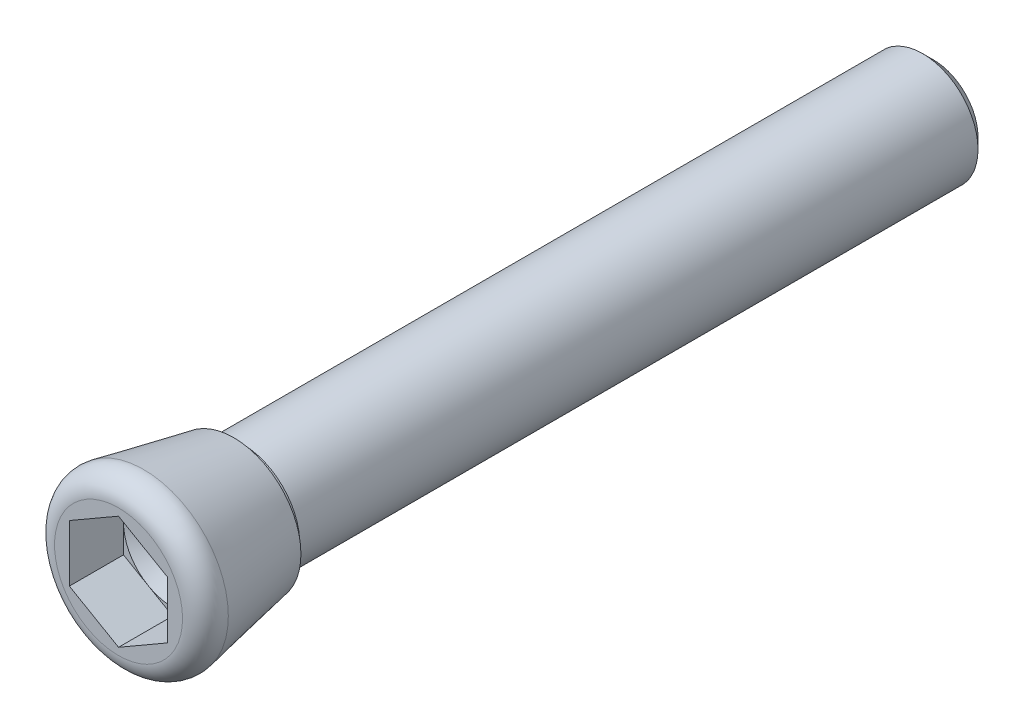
ISO-10303-21;
HEADER;
FILE_DESCRIPTION(('STEP AP214'),'2;1');
FILE_NAME('part.step','',(''),(''),'','','');
FILE_SCHEMA(('AUTOMOTIVE_DESIGN { 1 0 10303 214 1 1 1 1 }'));
ENDSEC;
DATA;
#1=APPLICATION_CONTEXT('core data for automotive mechanical design processes');
#2=APPLICATION_PROTOCOL_DEFINITION('international standard','automotive_design',2000,#1);
#3=PRODUCT_CONTEXT('',#1,'mechanical');
#4=PRODUCT('Part','Part','',(#3));
#5=PRODUCT_RELATED_PRODUCT_CATEGORY('part','',(#4));
#6=PRODUCT_DEFINITION_FORMATION('','',#4);
#7=PRODUCT_DEFINITION_CONTEXT('part definition',#1,'design');
#8=PRODUCT_DEFINITION('design','',#6,#7);
#9=PRODUCT_DEFINITION_SHAPE('','',#8);
#10=(LENGTH_UNIT() NAMED_UNIT(*) SI_UNIT(.MILLI.,.METRE.));
#11=(NAMED_UNIT(*) PLANE_ANGLE_UNIT() SI_UNIT($,.RADIAN.));
#12=(NAMED_UNIT(*) SI_UNIT($,.STERADIAN.) SOLID_ANGLE_UNIT());
#13=UNCERTAINTY_MEASURE_WITH_UNIT(LENGTH_MEASURE(1.E-05),#10,'distance_accuracy_value','');
#14=(GEOMETRIC_REPRESENTATION_CONTEXT(3) GLOBAL_UNCERTAINTY_ASSIGNED_CONTEXT((#13)) GLOBAL_UNIT_ASSIGNED_CONTEXT((#10,
#11,#12)) REPRESENTATION_CONTEXT('',''));
#15=CARTESIAN_POINT('',(0.,0.,0.));
#16=DIRECTION('',(0.,0.,1.));
#17=DIRECTION('',(1.,0.,0.));
#18=AXIS2_PLACEMENT_3D('',#15,#16,#17);
#19=CARTESIAN_POINT('',(0.,3.429,-4.1656));
#20=DIRECTION('',(0.,0.,-1.));
#21=DIRECTION('',(-1.,0.,0.));
#22=AXIS2_PLACEMENT_3D('',#19,#20,#21);
#23=PLANE('',#22);
#24=CARTESIAN_POINT('',(0.,0.,-4.1656));
#25=DIRECTION('',(0.,0.,-1.));
#26=DIRECTION('',(-1.,0.,0.));
#27=AXIS2_PLACEMENT_3D('',#24,#25,#26);
#28=CIRCLE('',#27,2.38759999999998);
#29=CARTESIAN_POINT('',(-2.38759999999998,0.,-4.1656));
#30=VERTEX_POINT('',#29);
#31=EDGE_CURVE('E9',#30,#30,#28,.F.);
#32=ORIENTED_EDGE('',*,*,#31,.T.);
#33=EDGE_LOOP('',(#32));
#34=FACE_BOUND('',#33,.T.);
#35=CARTESIAN_POINT('',(0.,0.,-4.1656));
#36=DIRECTION('',(0.,0.,-1.));
#37=DIRECTION('',(-1.,0.,0.));
#38=AXIS2_PLACEMENT_3D('',#35,#36,#37);
#39=CIRCLE('',#38,2.42878938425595);
#40=CARTESIAN_POINT('',(-2.42878938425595,0.,-4.1656));
#41=VERTEX_POINT('',#40);
#42=EDGE_CURVE('E114',#41,#41,#39,.T.);
#43=ORIENTED_EDGE('',*,*,#42,.T.);
#44=EDGE_LOOP('',(#43));
#45=FACE_BOUND('',#44,.T.);
#46=ADVANCED_FACE('F14',(#34,#45),#23,.T.);
#47=CARTESIAN_POINT('',(0.,0.,-4.4704));
#48=DIRECTION('',(0.,0.,-1.));
#49=DIRECTION('',(-1.,0.,0.));
#50=AXIS2_PLACEMENT_3D('',#47,#48,#49);
#51=TOROIDAL_SURFACE('',#50,2.38759999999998,0.3048);
#52=CARTESIAN_POINT('',(0.,0.,-4.4704));
#53=DIRECTION('',(0.,0.,-1.));
#54=DIRECTION('',(-1.,0.,0.));
#55=AXIS2_PLACEMENT_3D('',#52,#53,#54);
#56=CIRCLE('',#55,2.08279999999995);
#57=CARTESIAN_POINT('',(-2.08279999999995,0.,-4.4704));
#58=VERTEX_POINT('',#57);
#59=EDGE_CURVE('E209',#58,#58,#56,.F.);
#60=ORIENTED_EDGE('',*,*,#59,.T.);
#61=EDGE_LOOP('',(#60));
#62=FACE_BOUND('',#61,.T.);
#63=ORIENTED_EDGE('',*,*,#31,.F.);
#64=EDGE_LOOP('',(#63));
#65=FACE_BOUND('',#64,.T.);
#66=ADVANCED_FACE('F186',(#62,#65),#51,.F.);
#67=CARTESIAN_POINT('',(0.,0.,-0.907396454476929));
#68=DIRECTION('',(0.,0.,1.));
#69=DIRECTION('',(1.,0.,0.));
#70=AXIS2_PLACEMENT_3D('',#67,#68,#69);
#71=CONICAL_SURFACE('',#70,3.06211999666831,0.19198621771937);
#72=ORIENTED_EDGE('',*,*,#42,.F.);
#73=EDGE_LOOP('',(#72));
#74=FACE_BOUND('',#73,.T.);
#75=CARTESIAN_POINT('',(0.,0.,-0.907396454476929));
#76=DIRECTION('',(0.,0.,1.));
#77=DIRECTION('',(1.,0.,0.));
#78=AXIS2_PLACEMENT_3D('',#75,#76,#77);
#79=CIRCLE('',#78,3.06211999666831);
#80=CARTESIAN_POINT('',(3.06211999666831,0.,-0.907396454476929));
#81=VERTEX_POINT('',#80);
#82=EDGE_CURVE('E117',#81,#81,#79,.T.);
#83=ORIENTED_EDGE('',*,*,#82,.F.);
#84=EDGE_LOOP('',(#83));
#85=FACE_BOUND('',#84,.T.);
#86=ADVANCED_FACE('F192',(#74,#85),#71,.T.);
#87=CARTESIAN_POINT('',(0.,0.,-0.762));
#88=DIRECTION('',(0.,0.,1.));
#89=DIRECTION('',(1.,0.,0.));
#90=AXIS2_PLACEMENT_3D('',#87,#88,#89);
#91=TOROIDAL_SURFACE('',#90,2.31412008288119,0.762);
#92=ORIENTED_EDGE('',*,*,#82,.T.);
#93=EDGE_LOOP('',(#92));
#94=FACE_BOUND('',#93,.T.);
#95=CARTESIAN_POINT('',(0.,0.,0.));
#96=DIRECTION('',(0.,0.,1.));
#97=DIRECTION('',(1.,0.,0.));
#98=AXIS2_PLACEMENT_3D('',#95,#96,#97);
#99=CIRCLE('',#98,2.31412008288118);
#100=CARTESIAN_POINT('',(2.31412008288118,0.,0.));
#101=VERTEX_POINT('',#100);
#102=EDGE_CURVE('E205',#101,#101,#99,.T.);
#103=ORIENTED_EDGE('',*,*,#102,.F.);
#104=EDGE_LOOP('',(#103));
#105=FACE_BOUND('',#104,.T.);
#106=ADVANCED_FACE('F200',(#94,#105),#91,.T.);
#107=CARTESIAN_POINT('',(0.,0.,-1.9558));
#108=DIRECTION('',(0.,0.,1.));
#109=DIRECTION('',(1.,0.,0.));
#110=AXIS2_PLACEMENT_3D('',#107,#108,#109);
#111=CONICAL_SURFACE('',#110,1.778,1.04719755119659);
#112=CARTESIAN_POINT('',(0.,0.,-2.98232877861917));
#113=VERTEX_POINT('',#112);
#114=VERTEX_LOOP('',#113);
#115=FACE_BOUND('',#114,.T.);
#116=CARTESIAN_POINT('',(0.,0.,-1.9558));
#117=DIRECTION('',(0.,0.,1.));
#118=DIRECTION('',(1.,0.,0.));
#119=AXIS2_PLACEMENT_3D('',#116,#117,#118);
#120=CIRCLE('',#119,1.778);
#121=CARTESIAN_POINT('',(1.778,0.,-1.9558));
#122=VERTEX_POINT('',#121);
#123=CARTESIAN_POINT('',(0.889,1.53979316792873,-1.9558));
#124=VERTEX_POINT('',#123);
#125=EDGE_CURVE('E160',#122,#124,#120,.T.);
#126=ORIENTED_EDGE('',*,*,#125,.T.);
#127=CARTESIAN_POINT('',(-0.889,1.53979316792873,-1.9558));
#128=VERTEX_POINT('',#127);
#129=EDGE_CURVE('E163',#124,#128,#120,.T.);
#130=ORIENTED_EDGE('',*,*,#129,.T.);
#131=CARTESIAN_POINT('',(-1.778,0.,-1.9558));
#132=VERTEX_POINT('',#131);
#133=EDGE_CURVE('E290',#128,#132,#120,.T.);
#134=ORIENTED_EDGE('',*,*,#133,.T.);
#135=CARTESIAN_POINT('',(-0.889,-1.53979316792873,-1.9558));
#136=VERTEX_POINT('',#135);
#137=EDGE_CURVE('E286',#132,#136,#120,.T.);
#138=ORIENTED_EDGE('',*,*,#137,.T.);
#139=CARTESIAN_POINT('',(0.889,-1.53979316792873,-1.9558));
#140=VERTEX_POINT('',#139);
#141=EDGE_CURVE('E284',#136,#140,#120,.T.);
#142=ORIENTED_EDGE('',*,*,#141,.T.);
#143=EDGE_CURVE('E108',#140,#122,#120,.T.);
#144=ORIENTED_EDGE('',*,*,#143,.T.);
#145=EDGE_LOOP('',(#126,#130,#134,#138,#142,#144));
#146=FACE_BOUND('',#145,.T.);
#147=ADVANCED_FACE('F237',(#115,#146),#111,.F.);
#148=CARTESIAN_POINT('',(0.,2.05305755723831,-1.9558));
#149=DIRECTION('',(0.,0.,-1.));
#150=DIRECTION('',(-1.,0.,0.));
#151=AXIS2_PLACEMENT_3D('',#148,#149,#150);
#152=PLANE('',#151);
#153=DIRECTION('',(-0.866025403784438,-0.5,0.));
#154=VECTOR('',#153,1.);
#155=CARTESIAN_POINT('',(0.,2.05305755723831,-1.9558));
#156=LINE('',#155,#154);
#157=CARTESIAN_POINT('',(-1.778,1.02652877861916,-1.9558));
#158=VERTEX_POINT('',#157);
#159=EDGE_CURVE('E144',#128,#158,#156,.T.);
#160=ORIENTED_EDGE('',*,*,#159,.T.);
#161=DIRECTION('',(0.,-1.,0.));
#162=VECTOR('',#161,1.);
#163=CARTESIAN_POINT('',(-1.778,1.02652877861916,-1.9558));
#164=LINE('',#163,#162);
#165=EDGE_CURVE('E31',#158,#132,#164,.T.);
#166=ORIENTED_EDGE('',*,*,#165,.T.);
#167=ORIENTED_EDGE('',*,*,#133,.F.);
#168=EDGE_LOOP('',(#160,#166,#167));
#169=FACE_BOUND('',#168,.T.);
#170=ADVANCED_FACE('F243',(#169),#152,.F.);
#171=CARTESIAN_POINT('',(-1.778,-1.02652877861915,-1.9558));
#172=VERTEX_POINT('',#171);
#173=EDGE_CURVE('E142',#132,#172,#164,.T.);
#174=ORIENTED_EDGE('',*,*,#173,.T.);
#175=DIRECTION('',(-0.866025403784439,0.5,0.));
#176=VECTOR('',#175,1.);
#177=CARTESIAN_POINT('',(0.,-2.05305755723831,-1.9558));
#178=LINE('',#177,#176);
#179=EDGE_CURVE('E138',#136,#172,#178,.T.);
#180=ORIENTED_EDGE('',*,*,#179,.F.);
#181=ORIENTED_EDGE('',*,*,#137,.F.);
#182=EDGE_LOOP('',(#174,#180,#181));
#183=FACE_BOUND('',#182,.T.);
#184=ADVANCED_FACE('F239',(#183),#152,.F.);
#185=CARTESIAN_POINT('',(0.,-2.05305755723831,-1.9558));
#186=VERTEX_POINT('',#185);
#187=EDGE_CURVE('E139',#186,#136,#178,.T.);
#188=ORIENTED_EDGE('',*,*,#187,.F.);
#189=DIRECTION('',(-0.866025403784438,-0.5,0.));
#190=VECTOR('',#189,1.);
#191=CARTESIAN_POINT('',(1.778,-1.02652877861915,-1.9558));
#192=LINE('',#191,#190);
#193=EDGE_CURVE('E134',#140,#186,#192,.T.);
#194=ORIENTED_EDGE('',*,*,#193,.F.);
#195=ORIENTED_EDGE('',*,*,#141,.F.);
#196=EDGE_LOOP('',(#188,#194,#195));
#197=FACE_BOUND('',#196,.T.);
#198=ADVANCED_FACE('F242',(#197),#152,.F.);
#199=CARTESIAN_POINT('',(1.778,-1.02652877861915,-1.9558));
#200=VERTEX_POINT('',#199);
#201=EDGE_CURVE('E135',#200,#140,#192,.T.);
#202=ORIENTED_EDGE('',*,*,#201,.F.);
#203=DIRECTION('',(0.,1.,0.));
#204=VECTOR('',#203,1.);
#205=CARTESIAN_POINT('',(1.778,-1.02652877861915,-1.9558));
#206=LINE('',#205,#204);
#207=EDGE_CURVE('E131',#200,#122,#206,.T.);
#208=ORIENTED_EDGE('',*,*,#207,.T.);
#209=ORIENTED_EDGE('',*,*,#143,.F.);
#210=EDGE_LOOP('',(#202,#208,#209));
#211=FACE_BOUND('',#210,.T.);
#212=ADVANCED_FACE('F280',(#211),#152,.F.);
#213=CARTESIAN_POINT('',(1.778,1.02652877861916,-1.9558));
#214=VERTEX_POINT('',#213);
#215=EDGE_CURVE('E130',#122,#214,#206,.T.);
#216=ORIENTED_EDGE('',*,*,#215,.T.);
#217=DIRECTION('',(0.866025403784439,-0.5,0.));
#218=VECTOR('',#217,1.);
#219=CARTESIAN_POINT('',(0.,2.05305755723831,-1.9558));
#220=LINE('',#219,#218);
#221=EDGE_CURVE('E107',#124,#214,#220,.T.);
#222=ORIENTED_EDGE('',*,*,#221,.F.);
#223=ORIENTED_EDGE('',*,*,#125,.F.);
#224=EDGE_LOOP('',(#216,#222,#223));
#225=FACE_BOUND('',#224,.T.);
#226=ADVANCED_FACE('F277',(#225),#152,.F.);
#227=CARTESIAN_POINT('',(0.,2.05305755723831,-1.9558));
#228=VERTEX_POINT('',#227);
#229=EDGE_CURVE('E128',#228,#124,#220,.T.);
#230=ORIENTED_EDGE('',*,*,#229,.F.);
#231=EDGE_CURVE('E145',#228,#128,#156,.T.);
#232=ORIENTED_EDGE('',*,*,#231,.T.);
#233=ORIENTED_EDGE('',*,*,#129,.F.);
#234=EDGE_LOOP('',(#230,#232,#233));
#235=FACE_BOUND('',#234,.T.);
#236=ADVANCED_FACE('F249',(#235),#152,.F.);
#237=CARTESIAN_POINT('',(0.,2.05305755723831,-1.9558));
#238=DIRECTION('',(-0.5,0.866025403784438,0.));
#239=DIRECTION('',(0.866025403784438,0.5,0.));
#240=AXIS2_PLACEMENT_3D('',#237,#238,#239);
#241=PLANE('',#240);
#242=DIRECTION('',(-0.866025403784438,-0.5,0.));
#243=VECTOR('',#242,1.);
#244=CARTESIAN_POINT('',(0.,2.05305755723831,0.));
#245=LINE('',#244,#243);
#246=CARTESIAN_POINT('',(0.,2.05305755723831,0.));
#247=VERTEX_POINT('',#246);
#248=CARTESIAN_POINT('',(-1.778,1.02652877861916,0.));
#249=VERTEX_POINT('',#248);
#250=EDGE_CURVE('E113',#247,#249,#245,.T.);
#251=ORIENTED_EDGE('',*,*,#250,.T.);
#252=DIRECTION('',(0.,0.,1.));
#253=VECTOR('',#252,1.);
#254=CARTESIAN_POINT('',(-1.778,1.02652877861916,-1.9558));
#255=LINE('',#254,#253);
#256=EDGE_CURVE('E150',#158,#249,#255,.T.);
#257=ORIENTED_EDGE('',*,*,#256,.F.);
#258=ORIENTED_EDGE('',*,*,#159,.F.);
#259=ORIENTED_EDGE('',*,*,#231,.F.);
#260=DIRECTION('',(0.,0.,1.));
#261=VECTOR('',#260,1.);
#262=CARTESIAN_POINT('',(0.,2.05305755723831,-1.9558));
#263=LINE('',#262,#261);
#264=EDGE_CURVE('E148',#228,#247,#263,.T.);
#265=ORIENTED_EDGE('',*,*,#264,.T.);
#266=EDGE_LOOP('',(#251,#257,#258,#259,#265));
#267=FACE_BOUND('',#266,.T.);
#268=ADVANCED_FACE('F245',(#267),#241,.F.);
#269=CARTESIAN_POINT('',(-1.778,1.02652877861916,-1.9558));
#270=DIRECTION('',(-1.,0.,0.));
#271=DIRECTION('',(0.,1.,0.));
#272=AXIS2_PLACEMENT_3D('',#269,#270,#271);
#273=PLANE('',#272);
#274=DIRECTION('',(0.,-1.,0.));
#275=VECTOR('',#274,1.);
#276=CARTESIAN_POINT('',(-1.778,1.02652877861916,0.));
#277=LINE('',#276,#275);
#278=CARTESIAN_POINT('',(-1.778,-1.02652877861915,0.));
#279=VERTEX_POINT('',#278);
#280=EDGE_CURVE('E125',#249,#279,#277,.T.);
#281=ORIENTED_EDGE('',*,*,#280,.T.);
#282=DIRECTION('',(0.,0.,1.));
#283=VECTOR('',#282,1.);
#284=CARTESIAN_POINT('',(-1.778,-1.02652877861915,-1.9558));
#285=LINE('',#284,#283);
#286=EDGE_CURVE('E153',#172,#279,#285,.T.);
#287=ORIENTED_EDGE('',*,*,#286,.F.);
#288=ORIENTED_EDGE('',*,*,#173,.F.);
#289=ORIENTED_EDGE('',*,*,#165,.F.);
#290=ORIENTED_EDGE('',*,*,#256,.T.);
#291=EDGE_LOOP('',(#281,#287,#288,#289,#290));
#292=FACE_BOUND('',#291,.T.);
#293=ADVANCED_FACE('F248',(#292),#273,.F.);
#294=CARTESIAN_POINT('',(0.,-2.05305755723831,-1.9558));
#295=DIRECTION('',(0.5,0.866025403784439,0.));
#296=DIRECTION('',(0.866025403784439,-0.5,0.));
#297=AXIS2_PLACEMENT_3D('',#294,#295,#296);
#298=PLANE('',#297);
#299=DIRECTION('',(-0.866025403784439,0.5,0.));
#300=VECTOR('',#299,1.);
#301=CARTESIAN_POINT('',(0.,-2.05305755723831,0.));
#302=LINE('',#301,#300);
#303=CARTESIAN_POINT('',(0.,-2.05305755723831,0.));
#304=VERTEX_POINT('',#303);
#305=EDGE_CURVE('E122',#304,#279,#302,.T.);
#306=ORIENTED_EDGE('',*,*,#305,.F.);
#307=DIRECTION('',(0.,0.,1.));
#308=VECTOR('',#307,1.);
#309=CARTESIAN_POINT('',(0.,-2.05305755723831,-1.9558));
#310=LINE('',#309,#308);
#311=EDGE_CURVE('E156',#186,#304,#310,.T.);
#312=ORIENTED_EDGE('',*,*,#311,.F.);
#313=ORIENTED_EDGE('',*,*,#187,.T.);
#314=ORIENTED_EDGE('',*,*,#179,.T.);
#315=ORIENTED_EDGE('',*,*,#286,.T.);
#316=EDGE_LOOP('',(#306,#312,#313,#314,#315));
#317=FACE_BOUND('',#316,.T.);
#318=ADVANCED_FACE('F253',(#317),#298,.T.);
#319=CARTESIAN_POINT('',(1.778,-1.02652877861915,-1.9558));
#320=DIRECTION('',(-0.5,0.866025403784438,0.));
#321=DIRECTION('',(0.866025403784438,0.5,0.));
#322=AXIS2_PLACEMENT_3D('',#319,#320,#321);
#323=PLANE('',#322);
#324=DIRECTION('',(-0.866025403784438,-0.5,0.));
#325=VECTOR('',#324,1.);
#326=CARTESIAN_POINT('',(1.778,-1.02652877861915,0.));
#327=LINE('',#326,#325);
#328=CARTESIAN_POINT('',(1.778,-1.02652877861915,0.));
#329=VERTEX_POINT('',#328);
#330=EDGE_CURVE('E98',#329,#304,#327,.T.);
#331=ORIENTED_EDGE('',*,*,#330,.F.);
#332=DIRECTION('',(0.,0.,1.));
#333=VECTOR('',#332,1.);
#334=CARTESIAN_POINT('',(1.778,-1.02652877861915,-1.9558));
#335=LINE('',#334,#333);
#336=EDGE_CURVE('E94',#200,#329,#335,.T.);
#337=ORIENTED_EDGE('',*,*,#336,.F.);
#338=ORIENTED_EDGE('',*,*,#201,.T.);
#339=ORIENTED_EDGE('',*,*,#193,.T.);
#340=ORIENTED_EDGE('',*,*,#311,.T.);
#341=EDGE_LOOP('',(#331,#337,#338,#339,#340));
#342=FACE_BOUND('',#341,.T.);
#343=ADVANCED_FACE('F257',(#342),#323,.T.);
#344=CARTESIAN_POINT('',(1.778,-1.02652877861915,-1.9558));
#345=DIRECTION('',(1.,0.,0.));
#346=DIRECTION('',(0.,-1.,0.));
#347=AXIS2_PLACEMENT_3D('',#344,#345,#346);
#348=PLANE('',#347);
#349=DIRECTION('',(0.,1.,0.));
#350=VECTOR('',#349,1.);
#351=CARTESIAN_POINT('',(1.778,-1.02652877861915,0.));
#352=LINE('',#351,#350);
#353=CARTESIAN_POINT('',(1.778,1.02652877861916,0.));
#354=VERTEX_POINT('',#353);
#355=EDGE_CURVE('E88',#329,#354,#352,.T.);
#356=ORIENTED_EDGE('',*,*,#355,.T.);
#357=DIRECTION('',(0.,0.,1.));
#358=VECTOR('',#357,1.);
#359=CARTESIAN_POINT('',(1.778,1.02652877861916,-1.9558));
#360=LINE('',#359,#358);
#361=EDGE_CURVE('E92',#214,#354,#360,.T.);
#362=ORIENTED_EDGE('',*,*,#361,.F.);
#363=ORIENTED_EDGE('',*,*,#215,.F.);
#364=ORIENTED_EDGE('',*,*,#207,.F.);
#365=ORIENTED_EDGE('',*,*,#336,.T.);
#366=EDGE_LOOP('',(#356,#362,#363,#364,#365));
#367=FACE_BOUND('',#366,.T.);
#368=ADVANCED_FACE('F90',(#367),#348,.F.);
#369=CARTESIAN_POINT('',(0.,2.05305755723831,-1.9558));
#370=DIRECTION('',(-0.5,-0.866025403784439,0.));
#371=DIRECTION('',(-0.866025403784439,0.5,0.));
#372=AXIS2_PLACEMENT_3D('',#369,#370,#371);
#373=PLANE('',#372);
#374=DIRECTION('',(0.866025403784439,-0.5,0.));
#375=VECTOR('',#374,1.);
#376=CARTESIAN_POINT('',(0.,2.05305755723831,0.));
#377=LINE('',#376,#375);
#378=EDGE_CURVE('E99',#247,#354,#377,.T.);
#379=ORIENTED_EDGE('',*,*,#378,.F.);
#380=ORIENTED_EDGE('',*,*,#264,.F.);
#381=ORIENTED_EDGE('',*,*,#229,.T.);
#382=ORIENTED_EDGE('',*,*,#221,.T.);
#383=ORIENTED_EDGE('',*,*,#361,.T.);
#384=EDGE_LOOP('',(#379,#380,#381,#382,#383));
#385=FACE_BOUND('',#384,.T.);
#386=ADVANCED_FACE('F103',(#385),#373,.T.);
#387=CARTESIAN_POINT('',(0.,0.,0.));
#388=DIRECTION('',(0.,0.,1.));
#389=DIRECTION('',(1.,0.,0.));
#390=AXIS2_PLACEMENT_3D('',#387,#388,#389);
#391=PLANE('',#390);
#392=ORIENTED_EDGE('',*,*,#378,.T.);
#393=ORIENTED_EDGE('',*,*,#355,.F.);
#394=ORIENTED_EDGE('',*,*,#330,.T.);
#395=ORIENTED_EDGE('',*,*,#305,.T.);
#396=ORIENTED_EDGE('',*,*,#280,.F.);
#397=ORIENTED_EDGE('',*,*,#250,.F.);
#398=EDGE_LOOP('',(#392,#393,#394,#395,#396,#397));
#399=FACE_BOUND('',#398,.T.);
#400=ORIENTED_EDGE('',*,*,#102,.T.);
#401=EDGE_LOOP('',(#400));
#402=FACE_BOUND('',#401,.T.);
#403=ADVANCED_FACE('F16',(#399,#402),#391,.T.);
#404=CARTESIAN_POINT('',(0.,0.,-4.464));
#405=DIRECTION('',(0.,0.,-1.));
#406=DIRECTION('',(-1.,0.,0.));
#407=AXIS2_PLACEMENT_3D('',#404,#405,#406);
#408=CYLINDRICAL_SURFACE('',#407,2.);
#409=CARTESIAN_POINT('',(0.,0.,-4.464));
#410=DIRECTION('',(0.,0.,-1.));
#411=DIRECTION('',(-1.,0.,0.));
#412=AXIS2_PLACEMENT_3D('',#409,#410,#411);
#413=CIRCLE('',#412,2.);
#414=CARTESIAN_POINT('',(-2.,0.,-4.464));
#415=VERTEX_POINT('',#414);
#416=EDGE_CURVE('E216',#415,#415,#413,.T.);
#417=ORIENTED_EDGE('',*,*,#416,.T.);
#418=EDGE_LOOP('',(#417));
#419=FACE_BOUND('',#418,.T.);
#420=CARTESIAN_POINT('',(0.,0.,-29.07436));
#421=DIRECTION('',(0.,0.,1.));
#422=DIRECTION('',(1.,0.,0.));
#423=AXIS2_PLACEMENT_3D('',#420,#421,#422);
#424=CIRCLE('',#423,2.);
#425=CARTESIAN_POINT('',(2.,0.,-29.07436));
#426=VERTEX_POINT('',#425);
#427=EDGE_CURVE('E18',#426,#426,#424,.T.);
#428=ORIENTED_EDGE('',*,*,#427,.T.);
#429=EDGE_LOOP('',(#428));
#430=FACE_BOUND('',#429,.T.);
#431=ADVANCED_FACE('F220',(#419,#430),#408,.T.);
#432=CARTESIAN_POINT('',(0.,0.,-4.464));
#433=DIRECTION('',(0.,0.,-1.));
#434=DIRECTION('',(-1.,0.,0.));
#435=AXIS2_PLACEMENT_3D('',#432,#433,#434);
#436=CYLINDRICAL_SURFACE('',#435,2.08279999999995);
#437=CARTESIAN_POINT('',(0.,0.,-4.464));
#438=DIRECTION('',(0.,0.,-1.));
#439=DIRECTION('',(-1.,0.,0.));
#440=AXIS2_PLACEMENT_3D('',#437,#438,#439);
#441=CIRCLE('',#440,2.08279999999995);
#442=CARTESIAN_POINT('',(-2.08279999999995,0.,-4.464));
#443=VERTEX_POINT('',#442);
#444=EDGE_CURVE('E213',#443,#443,#441,.T.);
#445=ORIENTED_EDGE('',*,*,#444,.F.);
#446=EDGE_LOOP('',(#445));
#447=FACE_BOUND('',#446,.T.);
#448=ORIENTED_EDGE('',*,*,#59,.F.);
#449=EDGE_LOOP('',(#448));
#450=FACE_BOUND('',#449,.T.);
#451=ADVANCED_FACE('F181',(#447,#450),#436,.F.);
#452=CARTESIAN_POINT('',(0.,0.,-4.464));
#453=DIRECTION('',(0.,0.,-1.));
#454=DIRECTION('',(-1.,0.,0.));
#455=AXIS2_PLACEMENT_3D('',#452,#453,#454);
#456=PLANE('',#455);
#457=ORIENTED_EDGE('',*,*,#416,.F.);
#458=EDGE_LOOP('',(#457));
#459=FACE_BOUND('',#458,.T.);
#460=ORIENTED_EDGE('',*,*,#444,.T.);
#461=EDGE_LOOP('',(#460));
#462=FACE_BOUND('',#461,.T.);
#463=ADVANCED_FACE('F172',(#459,#462),#456,.T.);
#464=CARTESIAN_POINT('',(0.,1.61036,-29.464));
#465=DIRECTION('',(0.,0.,-1.));
#466=DIRECTION('',(-1.,0.,0.));
#467=AXIS2_PLACEMENT_3D('',#464,#465,#466);
#468=PLANE('',#467);
#469=CARTESIAN_POINT('',(0.,0.,-29.464));
#470=DIRECTION('',(0.,0.,1.));
#471=DIRECTION('',(1.,0.,0.));
#472=AXIS2_PLACEMENT_3D('',#469,#470,#471);
#473=CIRCLE('',#472,1.61036);
#474=CARTESIAN_POINT('',(1.61036,0.,-29.464));
#475=VERTEX_POINT('',#474);
#476=EDGE_CURVE('E23',#475,#475,#473,.T.);
#477=ORIENTED_EDGE('',*,*,#476,.F.);
#478=EDGE_LOOP('',(#477));
#479=FACE_BOUND('',#478,.T.);
#480=ADVANCED_FACE('F170',(#479),#468,.T.);
#481=CARTESIAN_POINT('',(0.,0.,-29.464));
#482=DIRECTION('',(0.,0.,1.));
#483=DIRECTION('',(1.,0.,0.));
#484=AXIS2_PLACEMENT_3D('',#481,#482,#483);
#485=CONICAL_SURFACE('',#484,1.61036,0.785398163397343);
#486=ORIENTED_EDGE('',*,*,#476,.T.);
#487=EDGE_LOOP('',(#486));
#488=FACE_BOUND('',#487,.T.);
#489=ORIENTED_EDGE('',*,*,#427,.F.);
#490=EDGE_LOOP('',(#489));
#491=FACE_BOUND('',#490,.T.);
#492=ADVANCED_FACE('F167',(#488,#491),#485,.T.);
#493=CLOSED_SHELL('',(#46,#66,#86,#106,#147,#170,#184,#198,#212,#226,#236,#268,#293,#318,#343,
#368,#386,#403,#431,#451,#463,#480,#492));
#494=MANIFOLD_SOLID_BREP('B1',#493);
#495=ADVANCED_BREP_SHAPE_REPRESENTATION('',(#18,#494),#14);
#496=SHAPE_DEFINITION_REPRESENTATION(#9,#495);
ENDSEC;
END-ISO-10303-21;
